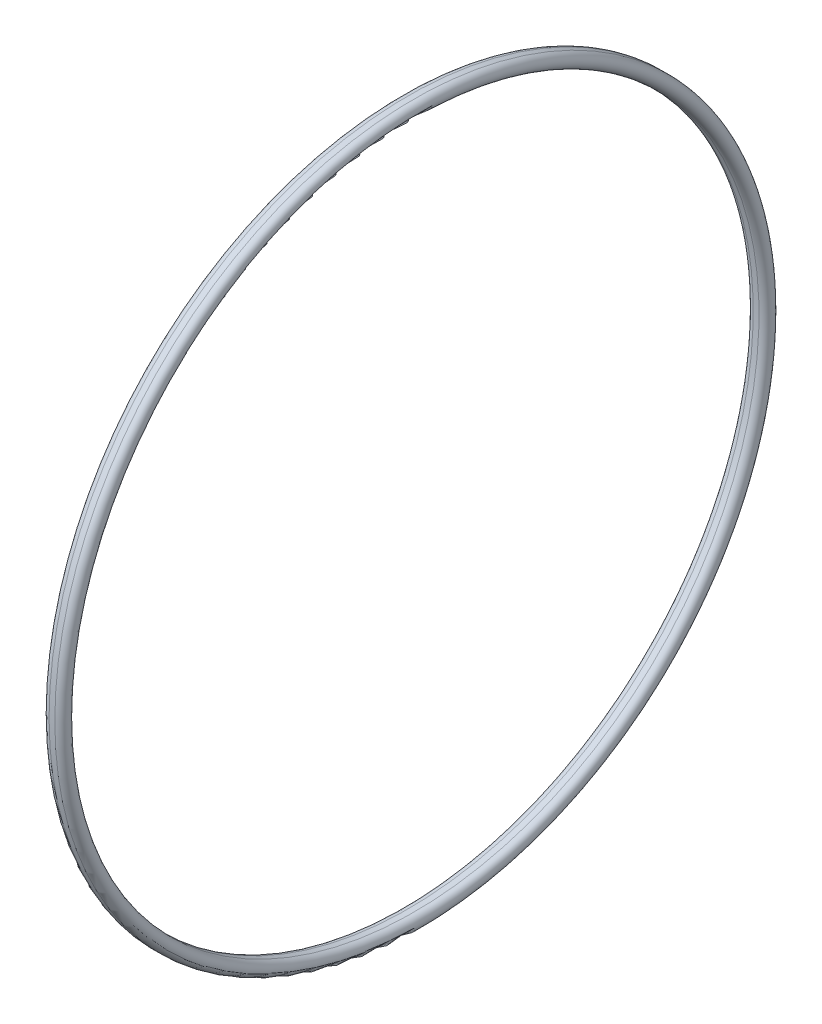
from build123d import *


with BuildPart() as part:
    # Sketch1 → Revolve1 (revolve)
    with BuildSketch(Plane.XY, mode=Mode.PRIVATE) as revolve1_sk:
        with BuildLine():
            Line((-0.254, 31.7373), (0.254, 31.7373))
            ThreePointArc((0.254, 31.7373), (0.86995, 31.12135), (0.254, 30.5054))
            Line((0.254, 30.5054), (-0.254, 30.5054))
            ThreePointArc((-0.254, 30.5054), (-0.86995, 31.12135), (-0.254, 31.7373))
        make_face()
    revolve(revolve1_sk.sketch.rotate(Axis((0, 0, 0), (1, 0, 0)), 90), axis=Axis((0, 0, 0), (1, 0, 0)))


solid = part.part
